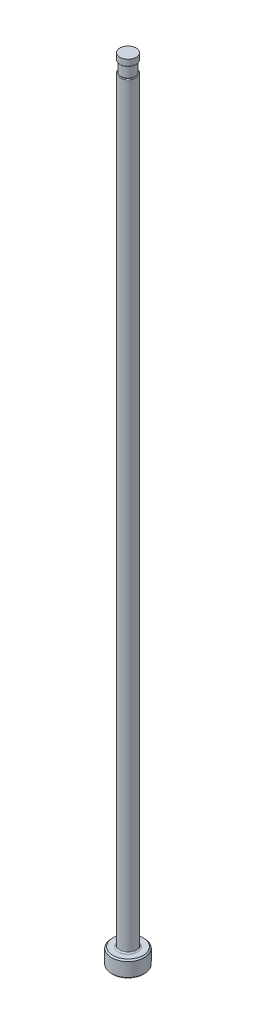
from build123d import *

# Parameters (mm, degrees)
CHAMFER1_SIZE     = 0.254
FILLET1_R         = 0.254
SKETCH2_W         = 0.2032
SKETCH2_H         = 2.032
D_SLOT_DEPTH      = 153.466131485
D_SLOT_DEPTH_BACK = 153.466131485
SKETCH5_W         = 0.01905
SKETCH5_H         = 1.27
FILLET2_R         = 0.127


with BuildPart() as part:
    # Sketch1 → Revolve1 (revolve)
    with BuildSketch(Plane.XY, mode=Mode.PRIVATE) as revolve1_sk:
        Polygon((0, 0), (-3.175, 0), (-3.175, 3.175), (-1.5875, 3.175), (-1.5875, 152.4), (0, 152.4), align=None)
    revolve(revolve1_sk.sketch.rotate(Axis((0, 259.958771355, 0), (0, -1, 0)), 270), axis=Axis((0, 259.958771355, 0), (0, -1, 0)))

    # Chamfer1
    chamfer1_edges = [part.edges().sort_by_distance(p)[0] for p in [
        (0, 3.175, -3.175),
        (0, 0, -3.175),
    ]]
    chamfer(chamfer1_edges, length=CHAMFER1_SIZE)

    # Fillet1
    fillet1_edges = [part.edges().sort_by_distance(p)[0] for p in [
        (0, 3.175, -1.5875),
    ]]
    fillet(fillet1_edges, radius=FILLET1_R)

    # Sketch2 → Vent Relief (revolve, cut)
    with BuildSketch(Plane.XY, mode=Mode.PRIVATE) as vent_relief_sk:
        with Locations((-1.4859, 150.114)):
            Rectangle(SKETCH2_W, SKETCH2_H)
    revolve(vent_relief_sk.sketch.rotate(Axis((0, 153.448281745, 0), (0, -1, 0)), 270), axis=Axis((0, 153.448281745, 0), (0, -1, 0)), mode=Mode.SUBTRACT)

    # Sketch3 → D-Slot (cut, two sides: drawn at the far end of the back side and taken through both)
    with BuildSketch(Plane.XY.offset(-D_SLOT_DEPTH_BACK)):
        with BuildLine():
            Line((-1.3843, 150.114), (-1.3843, 86.614))
            ThreePointArc((-1.3843, 86.614), (-1.435513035, 86.046038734), (-1.5875, 85.4964))
            Line((-1.5875, 85.4964), (-1.5875, 150.114))
            Line((-1.5875, 150.114), (-1.3843, 150.114))
        make_face()
    extrude(amount=D_SLOT_DEPTH + D_SLOT_DEPTH_BACK, mode=Mode.SUBTRACT)

    # Sketch5 → Vent Diameter (revolve, cut)
    with BuildSketch(Plane.XY, mode=Mode.PRIVATE) as vent_diameter_sk:
        with Locations((-1.577975, 151.765)):
            Rectangle(SKETCH5_W, SKETCH5_H)
    revolve(vent_diameter_sk.sketch.rotate(Axis((0, 152.687735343, 0), (0, -1, 0)), 90), axis=Axis((0, 152.687735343, 0), (0, -1, 0)), mode=Mode.SUBTRACT)

    # Fillet2
    fillet2_edges = [part.edges().sort_by_distance(p)[0] for p in [
        (1.369997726, 149.098, -0.802036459),
        (0, 151.13, 1.56845),
    ]]
    fillet(fillet2_edges, radius=FILLET2_R)


solid = part.part
